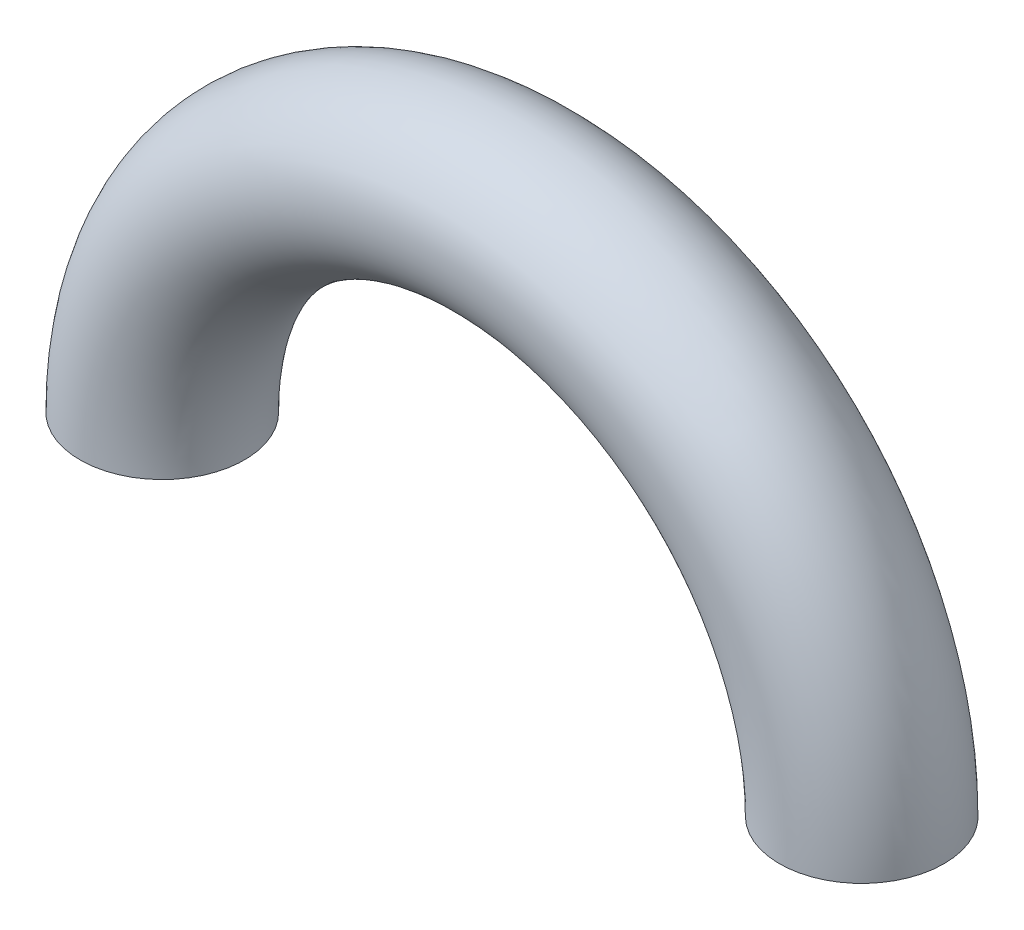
ISO-10303-21;
HEADER;
FILE_DESCRIPTION(('STEP AP214'),'2;1');
FILE_NAME('part.step','',(''),(''),'','','');
FILE_SCHEMA(('AUTOMOTIVE_DESIGN { 1 0 10303 214 1 1 1 1 }'));
ENDSEC;
DATA;
#1=APPLICATION_CONTEXT('core data for automotive mechanical design processes');
#2=APPLICATION_PROTOCOL_DEFINITION('international standard','automotive_design',2000,#1);
#3=PRODUCT_CONTEXT('',#1,'mechanical');
#4=PRODUCT('Part','Part','',(#3));
#5=PRODUCT_RELATED_PRODUCT_CATEGORY('part','',(#4));
#6=PRODUCT_DEFINITION_FORMATION('','',#4);
#7=PRODUCT_DEFINITION_CONTEXT('part definition',#1,'design');
#8=PRODUCT_DEFINITION('design','',#6,#7);
#9=PRODUCT_DEFINITION_SHAPE('','',#8);
#10=(LENGTH_UNIT() NAMED_UNIT(*) SI_UNIT(.MILLI.,.METRE.));
#11=(NAMED_UNIT(*) PLANE_ANGLE_UNIT() SI_UNIT($,.RADIAN.));
#12=(NAMED_UNIT(*) SI_UNIT($,.STERADIAN.) SOLID_ANGLE_UNIT());
#13=UNCERTAINTY_MEASURE_WITH_UNIT(LENGTH_MEASURE(1.E-05),#10,'distance_accuracy_value','');
#14=(GEOMETRIC_REPRESENTATION_CONTEXT(3) GLOBAL_UNCERTAINTY_ASSIGNED_CONTEXT((#13)) GLOBAL_UNIT_ASSIGNED_CONTEXT((#10,
#11,#12)) REPRESENTATION_CONTEXT('',''));
#15=CARTESIAN_POINT('',(0.,0.,0.));
#16=DIRECTION('',(0.,0.,1.));
#17=DIRECTION('',(1.,0.,0.));
#18=AXIS2_PLACEMENT_3D('',#15,#16,#17);
#19=CARTESIAN_POINT('',(0.,0.,0.));
#20=DIRECTION('',(0.,0.,-1.));
#21=DIRECTION('',(-1.,0.,0.));
#22=AXIS2_PLACEMENT_3D('',#19,#20,#21);
#23=TOROIDAL_SURFACE('',#22,17.,4.);
#24=CARTESIAN_POINT('',(-17.,0.,0.));
#25=DIRECTION('',(0.,-1.,0.));
#26=DIRECTION('',(0.,0.,1.));
#27=AXIS2_PLACEMENT_3D('',#24,#25,#26);
#28=CIRCLE('',#27,4.);
#29=CARTESIAN_POINT('',(-21.,0.,0.));
#30=VERTEX_POINT('',#29);
#31=EDGE_CURVE('E10',#30,#30,#28,.T.);
#32=CARTESIAN_POINT('',(17.,0.,0.));
#33=DIRECTION('',(0.,1.,0.));
#34=DIRECTION('',(0.,0.,1.));
#35=AXIS2_PLACEMENT_3D('',#32,#33,#34);
#36=CIRCLE('',#35,4.);
#37=CARTESIAN_POINT('',(21.,0.,0.));
#38=VERTEX_POINT('',#37);
#39=EDGE_CURVE('E37',#38,#38,#36,.T.);
#40=CARTESIAN_POINT('',(0.,0.,0.));
#41=DIRECTION('',(0.,0.,-1.));
#42=DIRECTION('',(-1.,0.,0.));
#43=AXIS2_PLACEMENT_3D('',#40,#41,#42);
#44=CIRCLE('',#43,21.);
#45=EDGE_CURVE('',#30,#38,#44,.T.);
#46=ORIENTED_EDGE('',*,*,#31,.F.);
#47=ORIENTED_EDGE('',*,*,#39,.T.);
#48=ORIENTED_EDGE('',*,*,#45,.T.);
#49=ORIENTED_EDGE('',*,*,#45,.F.);
#50=EDGE_LOOP('',(#46,#48,#47,#49));
#51=FACE_BOUND('',#50,.T.);
#52=ADVANCED_FACE('F31',(#51),#23,.T.);
#53=CARTESIAN_POINT('',(-17.,0.,0.));
#54=DIRECTION('',(0.,-1.,0.));
#55=DIRECTION('',(0.,0.,1.));
#56=AXIS2_PLACEMENT_3D('',#53,#54,#55);
#57=PLANE('',#56);
#58=ORIENTED_EDGE('',*,*,#31,.T.);
#59=EDGE_LOOP('',(#58));
#60=FACE_BOUND('',#59,.T.);
#61=ADVANCED_FACE('F46',(#60),#57,.T.);
#62=CARTESIAN_POINT('',(17.,0.,0.));
#63=DIRECTION('',(0.,1.,0.));
#64=DIRECTION('',(0.,0.,1.));
#65=AXIS2_PLACEMENT_3D('',#62,#63,#64);
#66=PLANE('',#65);
#67=ORIENTED_EDGE('',*,*,#39,.F.);
#68=EDGE_LOOP('',(#67));
#69=FACE_BOUND('',#68,.T.);
#70=ADVANCED_FACE('F44',(#69),#66,.F.);
#71=CLOSED_SHELL('',(#52,#61,#70));
#72=MANIFOLD_SOLID_BREP('B2',#71);
#73=ADVANCED_BREP_SHAPE_REPRESENTATION('',(#18,#72),#14);
#74=SHAPE_DEFINITION_REPRESENTATION(#9,#73);
ENDSEC;
END-ISO-10303-21;
